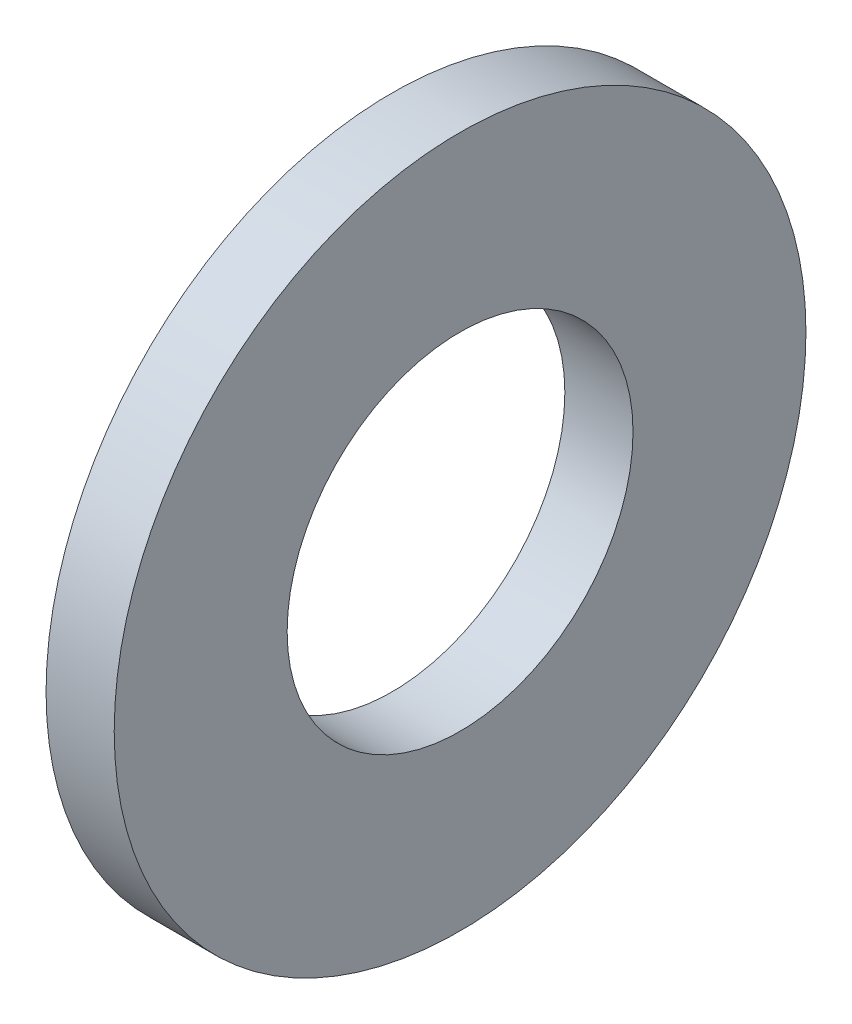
from build123d import *

# Parameters (mm, degrees)
SKETCH1_W = 1.016
SKETCH1_H = 2.5781


with BuildPart() as part:
    # Sketch1 → Base-Revolve (revolve)
    with BuildSketch(Plane.XY, mode=Mode.PRIVATE) as base_revolve_sk:
        with Locations((-0.508, 3.86715)):
            Rectangle(SKETCH1_W, SKETCH1_H)
    revolve(base_revolve_sk.sketch.rotate(Axis((-34.925, 0, 0), (1, 0, 0)), 90), axis=Axis((-34.925, 0, 0), (1, 0, 0)))


solid = part.part
